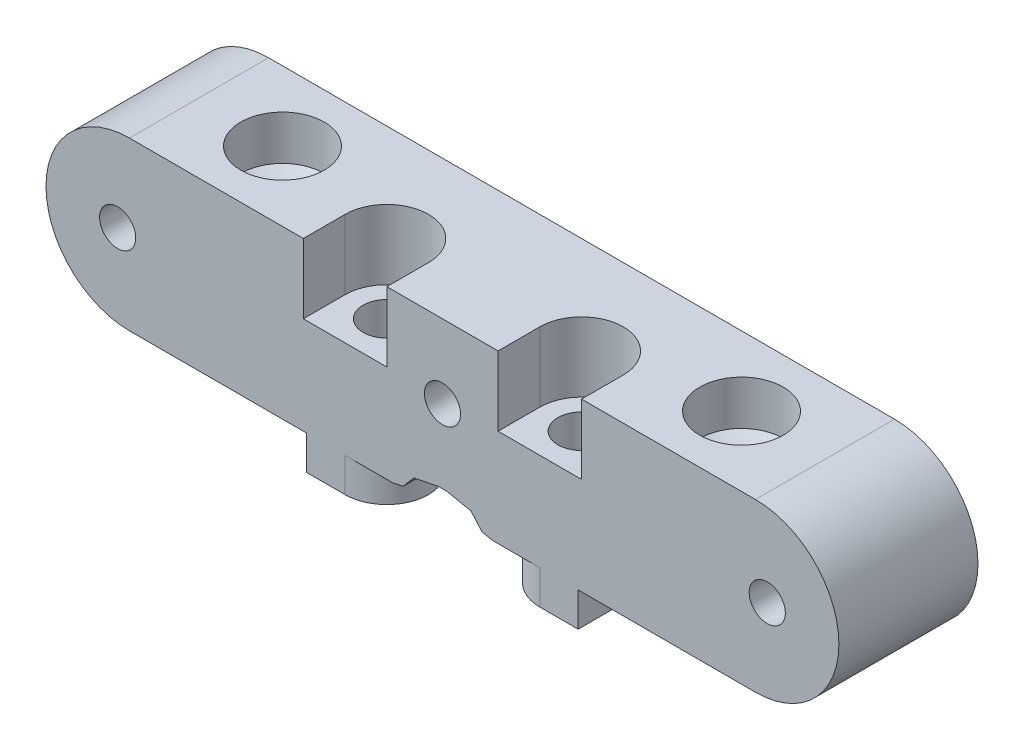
from build123d import *
from build123d.topology import SkipClean

# Parameters (mm, degrees)
SZKIC2_W                    = 45.000061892
SZKIC2_H                    = 10
SZKIC2_R                    = 1.7
DODANIE_WYCI_GNI_CIE1_DEPTH = 12
SZKIC3_W                    = 45.000061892
SZKIC3_H                    = 6.5
DODANIE_WYCI_GNI_CIE2_DEPTH = 14.5
SZKIC4_R                    = 1.7
WYTNIJ_WYCI_GNI_CIE1_DEPTH  = 92.835319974
WYTNIJ_WYCI_GNI_CIE2_DEPTH  = 46.083313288
WYTNIJ_WYCI_GNI_CIE3_DEPTH  = 93.149205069
DODANIE_WYCI_GNI_CIE4_DEPTH = 2.45
OTW_R_4_6_4_6_1_D           = 4.6
OTW_R_4_6_4_6_1_DEPTH       = 4.118020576
OTW_R_4_6_4_6_1_TIP         = 1.381979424
WYTNIJ_WYCI_GNI_CIE4_DEPTH  = 92.835319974
WYTNIJ_WYCI_GNI_CIE5_DEPTH  = 92.835319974
SZKIC18_R                   = 1.7
WYTNIJ_WYCI_GNI_CIE6_DEPTH  = 46.067256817
OTW_R_6_0_6_2_D             = 6
OTW_R_6_0_6_2_DEPTH         = 3.197418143
OTW_R_6_0_6_2_TIP           = 1.802581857
WYTNIJ_WYCI_GNI_CIE7_DEPTH  = 5
DODANIE_WYCI_GNI_CIE5_DEPTH = 10
SZKIC24_R                   = 1.3
WYTNIJ_WYCI_GNI_CIE8_DEPTH  = 83.869977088
OTW_R_4_6_4_6_2_D           = 4.6
OTW_R_4_6_4_6_2_DEPTH       = 4.618020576
OTW_R_4_6_4_6_2_TIP         = 1.381979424


with BuildPart() as part:
    # Szkic2 → Dodanie-wyci_gni_cie1 (new body)
    with BuildSketch(Plane(origin=(0, 55.165297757, 0), x_dir=(1.0, 3.1724579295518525e-12, 0), z_dir=(-3.1724579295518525e-12, 1.0, 0))):
        with Locations((19.000030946, 5)):
            Rectangle(SZKIC2_W, SZKIC2_H)
        with Locations(Location((35.500059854, 5, 0), (0, 0, 180))):
            Circle(SZKIC2_R, mode=Mode.SUBTRACT)
        with Locations(Location((2.5, 5, 0), (0, 0, 180))):
            Circle(SZKIC2_R, mode=Mode.SUBTRACT)
    extrude(amount=DODANIE_WYCI_GNI_CIE1_DEPTH)

    # Szkic3 → Dodanie-wyci_gni_cie2 (add)
    with BuildSketch(Plane(origin=(0, 67.165297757, 0), x_dir=(1.0, 3.172457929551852e-12, 0), z_dir=(-3.172457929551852e-12, 1.0, 0))):
        with Locations((19.000030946, 3.25)):
            Rectangle(SZKIC3_W, SZKIC3_H)
    extrude(amount=DODANIE_WYCI_GNI_CIE2_DEPTH)

    # Szkic4 → Wytnij-wyci_gni_cie1 (cut, through all)
    with BuildSketch(Plane(origin=(0, 0, -6.5), x_dir=(-1, 0, 0), z_dir=(0, 0, -1))):
        with Locations((-28.000030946, 75.787695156)):
            Circle(SZKIC4_R)
        with Locations((-10.000030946, 75.787695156)):
            Circle(SZKIC4_R)
    extrude(amount=-WYTNIJ_WYCI_GNI_CIE1_DEPTH, mode=Mode.SUBTRACT)

    # Szkic5 → Wytnij-wyci_gni_cie2 (cut, through all)
    with SkipClean():  # the faces are left unmerged after this step: merging them gives an invalid solid
        with BuildSketch(Plane.XZ.offset(-67.165297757)):
            with BuildLine():
                Line((34.700059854, -6.5), (36.300059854, -6.5))
                ThreePointArc((36.300059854, -6.5), (35.500059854, -3.3), (34.700059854, -6.5))
            make_face()
            with BuildLine():
                Line((1.7, -6.5), (3.3, -6.5))
                ThreePointArc((3.3, -6.5), (2.5, -3.3), (1.7, -6.5))
            make_face()
        extrude(amount=-WYTNIJ_WYCI_GNI_CIE2_DEPTH, mode=Mode.SUBTRACT)

    # Szkic7 → Wytnij-wyci_gni_cie3 (cut, through all)
    with SkipClean():  # the faces are left unmerged after this step: merging them gives an invalid solid
        with BuildSketch(Plane(origin=(0, 0, -10), x_dir=(-1, 0, 0), z_dir=(0, 0, -1))):
            Polygon((-18.700467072, 56.579969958), (-19.29959482, 56.579969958), (-21.049804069, 56.23010956), (-21.842673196, 55.315858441), (-28.386226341, 54.006531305), (-29.25589482, 52.945612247), (-29.25589482, 44.934983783), (-28.386229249, 43.874064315), (-21.842674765, 42.564737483), (-21.049803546, 41.650485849), (-19.299594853, 41.300625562), (-18.700465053, 41.300625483), (-16.950258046, 41.65048596), (-16.157389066, 42.564736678), (-9.613832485, 43.874064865), (-8.744167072, 44.934983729), (-8.744167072, 52.945611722), (-9.613832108, 54.006530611), (-16.157387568, 55.315858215), (-16.950258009, 56.230109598), align=None)
        extrude(amount=-WYTNIJ_WYCI_GNI_CIE3_DEPTH, mode=Mode.SUBTRACT)

    # Szkic13 → Dodanie-wyci_gni_cie4 (add)
    with SkipClean():  # the faces are left unmerged after this step: merging them gives an invalid solid
        with BuildSketch(Plane.XZ.offset(-55.165297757)):
            with BuildLine():
                Line((28.75589482, 0), (28.75589482, -6))
                Line((28.75589482, -6), (26.000030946, -6))
                ThreePointArc((26.000030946, -6), (23.000030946, -2.999996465), (26.000038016, 0))
                Line((26.000038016, 0), (28.75589482, 0))
            make_face()
            with BuildLine():
                Line((12.000030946, -6), (9.244167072, -6))
                Line((9.244167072, -6), (9.244167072, 0))
                Line((9.244167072, 0), (12.000021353, 0))
                ThreePointArc((12.000021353, 0), (15.000030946, -2.999995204), (12.000030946, -6))
            make_face()
        extrude(amount=DODANIE_WYCI_GNI_CIE4_DEPTH)

    # Otw_r _4.6 _4.6_1
    with Locations(Plane.XY):
        with Locations((28.000030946, 75.787695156), (10.000030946, 75.787695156)):
            Hole(OTW_R_4_6_4_6_1_D / 2, depth=OTW_R_4_6_4_6_1_DEPTH)
            with Locations((0, 0, -(OTW_R_4_6_4_6_1_DEPTH + OTW_R_4_6_4_6_1_TIP / 2))):  # 118° drill point
                Cone(0, OTW_R_4_6_4_6_1_D / 2, OTW_R_4_6_4_6_1_TIP, mode=Mode.SUBTRACT)

    # Szkic16 → Wytnij-wyci_gni_cie4 (cut, through all)
    with BuildSketch(Plane(origin=(0, 0, -6.5), x_dir=(-1, 0, 0), z_dir=(0, 0, -1))):
        with BuildLine():
            Line((-16.475947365, 81.665297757), (-8.964139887, 79.651233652))
            ThreePointArc((-8.964139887, 79.651233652), (-6.826423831, 78.222488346), (-6.000030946, 75.787695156))
            Line((-6.000030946, 75.787695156), (-6.000030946, 67.165297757))
            Line((-6.000030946, 67.165297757), (3.5, 67.165297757))
            Line((3.5, 67.165297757), (3.5, 81.665297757))
            Line((3.5, 81.665297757), (-16.475947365, 81.665297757))
        make_face()
        with BuildLine():
            Line((-29.035922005, 79.651233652), (-21.524114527, 81.665297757))
            Line((-21.524114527, 81.665297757), (-41.500061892, 81.665297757))
            Line((-41.500061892, 81.665297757), (-41.500061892, 67.165297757))
            Line((-41.500061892, 67.165297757), (-32.000030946, 67.165297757))
            Line((-32.000030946, 67.165297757), (-32.000030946, 75.787695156))
            ThreePointArc((-32.000030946, 75.787695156), (-31.173638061, 78.222488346), (-29.035922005, 79.651233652))
        make_face()
    extrude(amount=-WYTNIJ_WYCI_GNI_CIE4_DEPTH, mode=Mode.SUBTRACT)

    # Szkic17 → Wytnij-wyci_gni_cie5 (cut, through all)
    with BuildSketch(Plane(origin=(0, 0, -6.5), x_dir=(-1, 0, 0), z_dir=(0, 0, -1))):
        with BuildLine():
            Line((-8.964139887, 79.651233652), (-16.475947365, 81.665297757))
            Line((-16.475947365, 81.665297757), (-21.524114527, 81.665297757))
            Line((-21.524114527, 81.665297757), (-29.035922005, 79.651233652))
            ThreePointArc((-29.035922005, 79.651233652), (-31.173638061, 78.222488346), (-32.000030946, 75.787695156))
            Line((-32.000030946, 75.787695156), (-32.000030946, 67.165297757))
            Line((-32.000030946, 67.165297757), (-6.000030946, 67.165297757))
            Line((-6.000030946, 67.165297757), (-6.000030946, 75.787695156))
            ThreePointArc((-6.000030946, 75.787695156), (-6.826423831, 78.222488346), (-8.964139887, 79.651233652))
        make_face()
    extrude(amount=-WYTNIJ_WYCI_GNI_CIE5_DEPTH, mode=Mode.SUBTRACT)

    # Szkic18 → Wytnij-wyci_gni_cie6 (cut, through all)
    with BuildSketch(Plane.XZ.offset(-52.715297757)):
        with Locations((12.000030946, -3)):
            Circle(SZKIC18_R)
        with Locations((26.000030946, -3)):
            Circle(SZKIC18_R)
    extrude(amount=-WYTNIJ_WYCI_GNI_CIE6_DEPTH, mode=Mode.SUBTRACT)

    # Otw_r _6.0 _6_2
    with Locations(Plane(origin=(0, 67.165297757, 0), x_dir=(1.0, 3.172457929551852e-12, 0), z_dir=(-3.172457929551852e-12, 1.0, 0))):
        with Locations((35.500059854, 5), (2.5, 5)):
            Hole(OTW_R_6_0_6_2_D / 2, depth=OTW_R_6_0_6_2_DEPTH)
            with Locations((0, 0, -(OTW_R_6_0_6_2_DEPTH + OTW_R_6_0_6_2_TIP / 2))):  # 118° drill point
                Cone(0, OTW_R_6_0_6_2_D / 2, OTW_R_6_0_6_2_TIP, mode=Mode.SUBTRACT)

    # Szkic23 → Wytnij-wyci_gni_cie7 (cut)
    with BuildSketch(Plane(origin=(0, 67.165297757, 0), x_dir=(1.0, 3.172457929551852e-12, 0), z_dir=(-3.172457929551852e-12, 1.0, 0))):
        with BuildLine():
            Line((15.000030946, 3), (15.000030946, 0))
            ThreePointArc((15.000030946, 0), (12.000030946, -3), (9.000030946, 0))
            Line((9.000030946, 0), (9.000030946, 3))
            ThreePointArc((9.000030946, 3), (12.000030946, 6), (15.000030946, 3))
        make_face()
        with BuildLine():
            Line((29.000030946, 3), (29.000030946, 0))
            ThreePointArc((29.000030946, 0), (26.000030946, -3), (23.000030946, 0))
            Line((23.000030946, 0), (23.000030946, 3))
            ThreePointArc((23.000030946, 3), (26.000030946, 6), (29.000030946, 3))
        make_face()
    extrude(amount=-WYTNIJ_WYCI_GNI_CIE7_DEPTH, mode=Mode.SUBTRACT)

    # Szkic27 → Dodanie-wyci_gni_cie5 (add)
    with BuildSketch(Plane(origin=(0, 0, -10), x_dir=(-1, 0, 0), z_dir=(0, 0, -1))):
        with BuildLine():
            Line((-41.500061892, 67.165297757), (-41.500061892, 55.165297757))
            ThreePointArc((-41.500061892, 55.165297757), (-47.500061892, 61.165297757), (-41.500061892, 67.165297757))
        make_face()
        with BuildLine():
            Line((3.5, 67.165297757), (3.5, 55.165297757))
            ThreePointArc((3.5, 55.165297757), (9.5, 61.165297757), (3.5, 67.165297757))
        make_face()
    extrude(amount=-DODANIE_WYCI_GNI_CIE5_DEPTH)

    # Szkic24 → Wytnij-wyci_gni_cie8 (cut, through all)
    with BuildSketch(Plane(origin=(0, 0, -10), x_dir=(-1, 0, 0), z_dir=(0, 0, -1))):
        with Locations((-19.000030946, 61.872633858)):
            Circle(SZKIC24_R)
        with Locations((-42.350061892, 61.165297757)):
            Circle(SZKIC24_R)
        with Locations((4.35, 61.165297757)):
            Circle(SZKIC24_R)
    extrude(amount=-WYTNIJ_WYCI_GNI_CIE8_DEPTH, mode=Mode.SUBTRACT)

    # Otw_r _4.6 _4.6_2
    with Locations(Plane(origin=(0, 0, -10), x_dir=(-1, 0, 0), z_dir=(0, 0, -1))):
        with Locations((-19.000030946, 61.872633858), (-42.350061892, 61.165297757), (4.35, 61.165297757)):
            Hole(OTW_R_4_6_4_6_2_D / 2, depth=OTW_R_4_6_4_6_2_DEPTH)
            with Locations((0, 0, -(OTW_R_4_6_4_6_2_DEPTH + OTW_R_4_6_4_6_2_TIP / 2))):  # 118° drill point
                Cone(0, OTW_R_4_6_4_6_2_D / 2, OTW_R_4_6_4_6_2_TIP, mode=Mode.SUBTRACT)


solid = part.part
